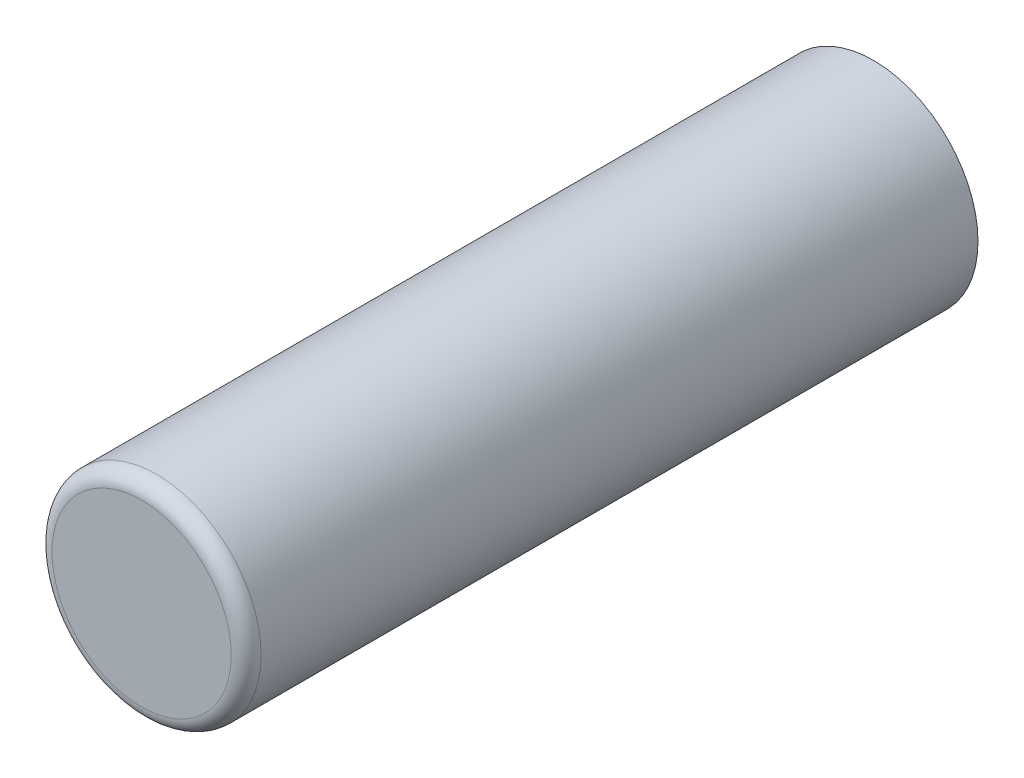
from build123d import *

# Parameters (mm, degrees)
SKIZZE1_R                       = 3.5
AUFSATZ_LINEAR_AUSTRAGEN1_DEPTH = 24.5
VERRUNDUNG1_R                   = 0.5


with BuildPart() as part:
    # Skizze1 → Aufsatz-Linear austragen1 (new body)
    with BuildSketch(Plane.XY):
        Circle(SKIZZE1_R)
    extrude(amount=AUFSATZ_LINEAR_AUSTRAGEN1_DEPTH)

    # Verrundung1
    verrundung1_edges = [part.edges().sort_by_distance(p)[0] for p in [
        (-3.5, 0, 24.5),
    ]]
    fillet(verrundung1_edges, radius=VERRUNDUNG1_R)


solid = part.part
